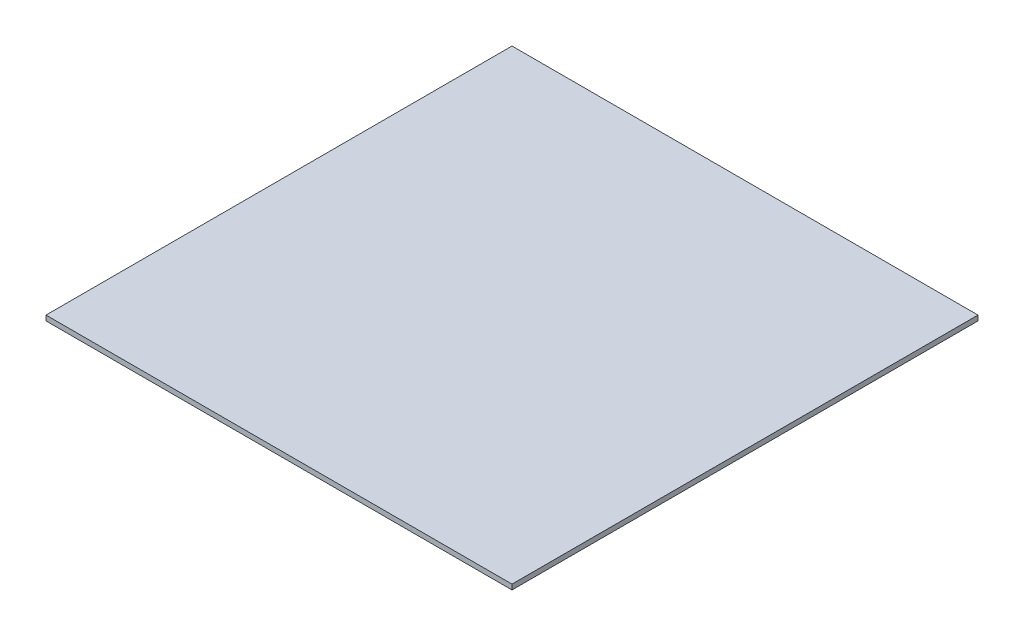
from build123d import *

# Parameters (mm, degrees)
SKETCH1_W      = 457.2
SKETCH1_H      = 457.2
EXTRUDE1_DEPTH = 5


with BuildPart() as part:
    # Sketch1 → Extrude1 (new body)
    with BuildSketch(Plane(origin=(0, 0, 0), x_dir=(1, 0, 0), z_dir=(0, 1, 0))):
        Rectangle(SKETCH1_W, SKETCH1_H)
    extrude(amount=-EXTRUDE1_DEPTH)


solid = part.part
